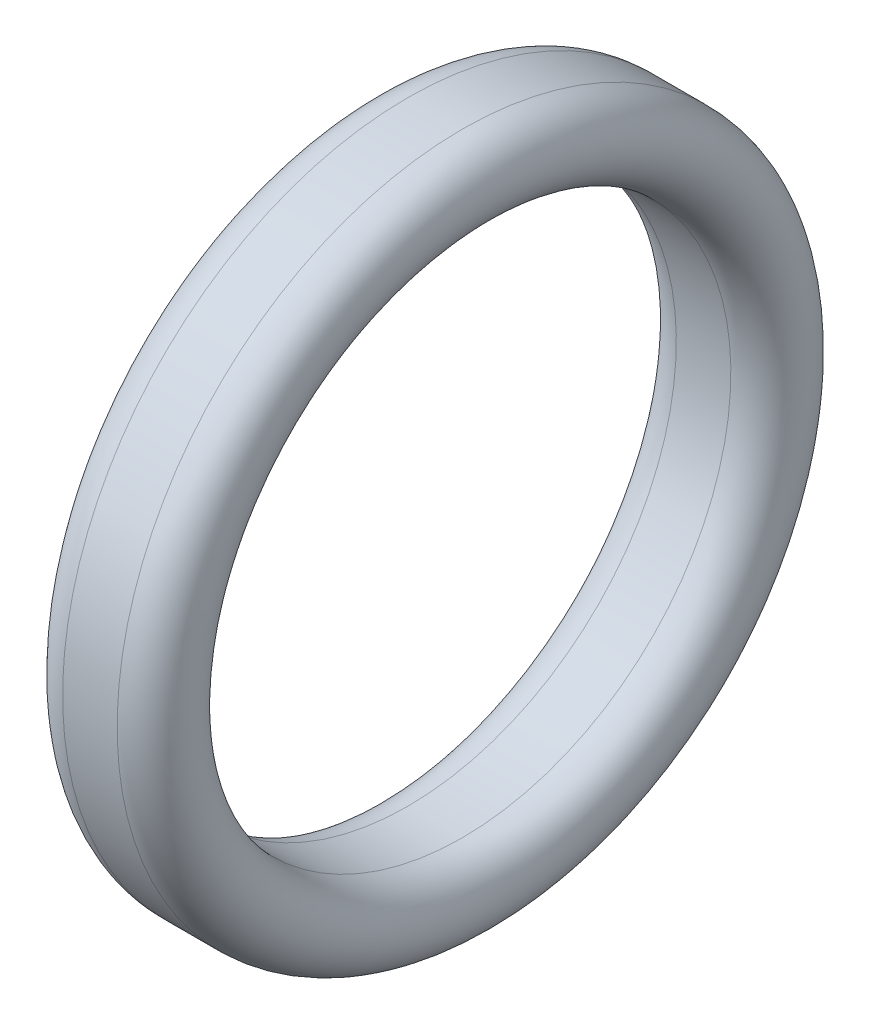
from build123d import *


with BuildPart() as part:
    # Sketch2 → Base-Revolve (revolve)
    with BuildSketch(Plane.XY, mode=Mode.PRIVATE) as base_revolve_sk:
        with BuildLine():
            Line((-54.7903, 12.7), (-52.7837, 12.7))
            ThreePointArc((-52.7837, 12.7), (-51.374, 11.2903), (-52.7837, 9.8806))
            Line((-52.7837, 9.8806), (-54.7903, 9.8806))
            ThreePointArc((-54.7903, 9.8806), (-56.2, 11.2903), (-54.7903, 12.7))
        make_face()
    revolve(base_revolve_sk.sketch.rotate(Axis((-75, 0, 0), (1, 0, 0)), 180), axis=Axis((-75, 0, 0), (1, 0, 0)))


solid = part.part
